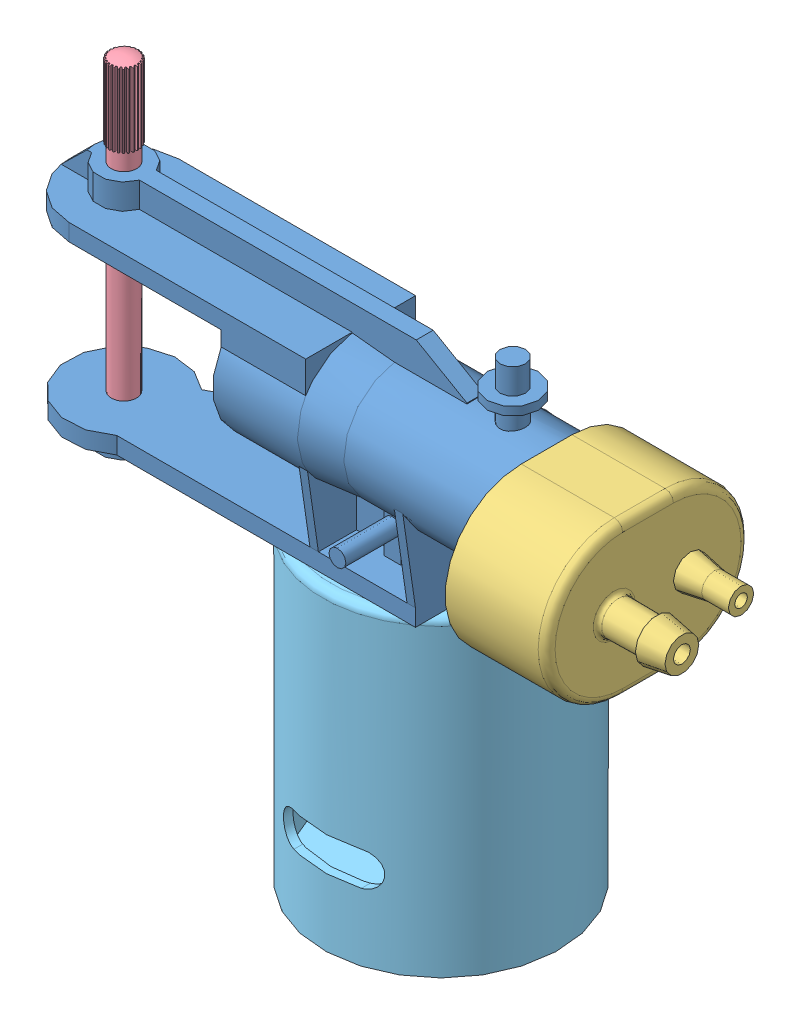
SolidWorks assembly BATI.SLDASM, configuration Défaut (file format 17000). Lengths in mm.
Overall size (79.52 79 45.3).
5 component instances, 5 part files, 10 mates.
Components (placement in the parent):
- corps de pompe-1: corps de pompe.SLDPRT [Défaut] at origin size (69.52 31.5 36)
- chemise-1: chemise.SLDPRT [Défaut] at (35 -8.038 2.0232) x (1 0 0) z (0 0.55429 0.832324) size (13 8 8)
- couvercle de pompe-1: couvercle de pompe.SLDPRT [Défaut] at (35 -5 6) x (0 0 -1) z (1 0 0) size (24 18 20)
- arbre de l'excentrique-1: arbre de l'excentrique.SLDPRT [Défaut] at (-18 16.5 0) x (0 -1 0) z (0.585545 0 0.81064) size (39 3.39 3.39)
- stator-1: stator.SLDPRT [Défaut] at (-0.884 -59.999 -0.6005) x (0 1 0) z (0.707107 0 0.707107) size (42.5 28 28)
Mates (geometry in assembly coordinates):
- Coaxial1: concentric aligned: cylinder of corps de pompe-1 through (1 -5 0) axis (-1 0 0) radius 5; cylinder of chemise-1 through (13 -5 0) axis (-1 0 0) radius 4
- Distance1: distance = 22 mm aligned: plane of corps de pompe-1 through (0 0 0) normal (-1 0 0); plane of chemise-1 through (22 -8.038 2.0232) normal (-1 0 0)
- Coaxial2: concentric aligned: cylinder of corps de pompe-1 through (28 -5 6) axis (-1 0 0) radius 7; cylinder of couvercle de pompe-1 through (47 -5 6) axis (-1 0 0) radius 9
- Coïncidente1: coincident anti-aligned: plane of corps de pompe-1 through (45 0 0) normal (1 0 0); plane of couvercle de pompe-1 through (45 -5 0) normal (-1 0 0)
- Parallèle1: parallel aligned: plane of corps de pompe-1 through (10 2.5 -6.5) normal (0 1 0); plane of couvercle de pompe-1 through (47 4 6) normal (0 1 0)
- Coaxial3: concentric anti-aligned: cylinder of corps de pompe-1 through (-18 5.5 0) axis (0 -1 0) radius 1.5; cylinder of arbre de l'excentrique-1 through (-18 21.5 0) axis (0 1 0) radius 1.5
- Distance2: distance = 3 mm: plane of corps de pompe-1 through (-18 5.5 0) normal (0 1 0); sphere of arbre de l'excentrique-1
- Coaxial4: concentric anti-aligned: cylinder of corps de pompe-1 through (9.0155 -22.999 -10.5) axis (0 1 0) radius 5.5; cylinder of stator-1 through (9.0155 -60.999 -10.5) axis (0 -1 0) radius 4.5
- Coaxial5: concentric aligned: cylinder of corps de pompe-1 through (0.5155 -22.999 -10.5) axis (0 1 0) radius 1.5; cylinder of stator-1 through (0.5155 -22.999 -10.5) axis (0 1 0) radius 1.025
- Coïncidente2: coincident anti-aligned: plane of corps de pompe-1 through (-18.0169 -22.999 0) normal (0 -1 0); plane of stator-1 through (5.8336 -22.999 -7.318) normal (0 1 0)
